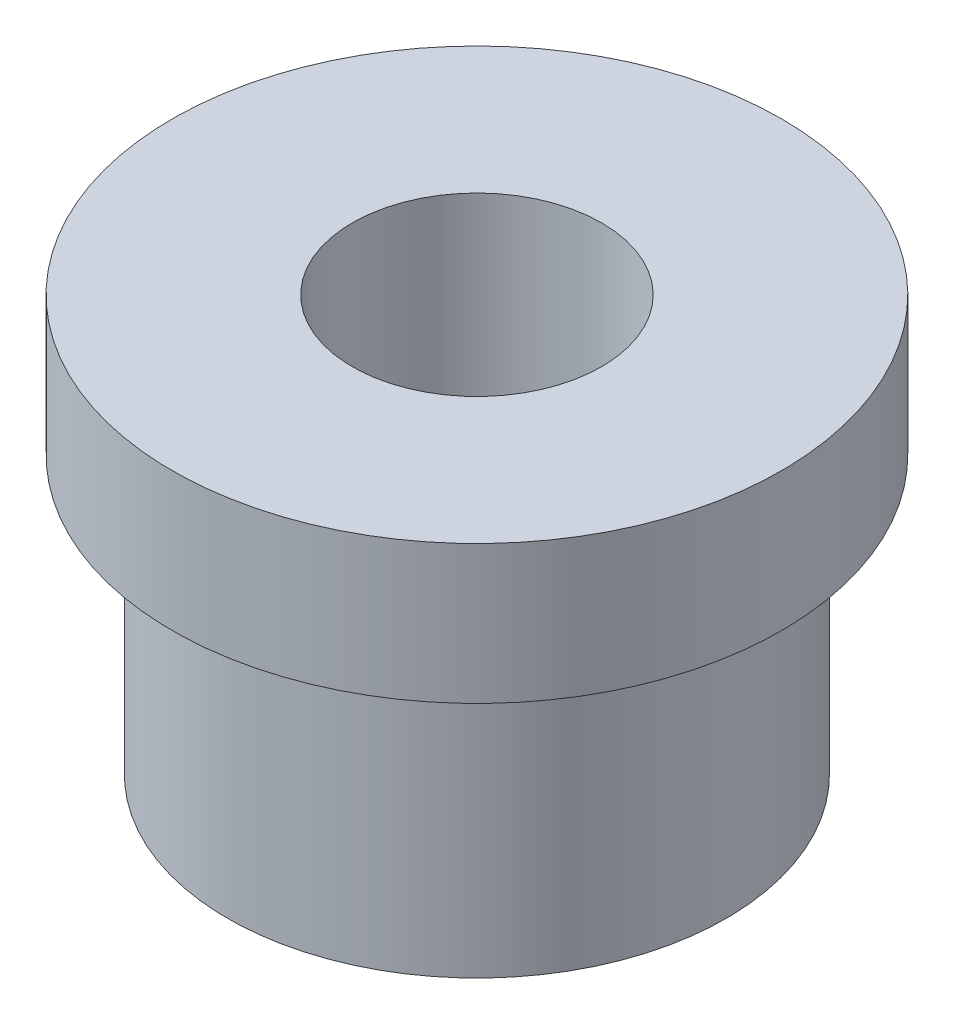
ISO-10303-21;
HEADER;
FILE_DESCRIPTION(('STEP AP214'),'2;1');
FILE_NAME('part.step','',(''),(''),'','','');
FILE_SCHEMA(('AUTOMOTIVE_DESIGN { 1 0 10303 214 1 1 1 1 }'));
ENDSEC;
DATA;
#1=APPLICATION_CONTEXT('core data for automotive mechanical design processes');
#2=APPLICATION_PROTOCOL_DEFINITION('international standard','automotive_design',2000,#1);
#3=PRODUCT_CONTEXT('',#1,'mechanical');
#4=PRODUCT('Part','Part','',(#3));
#5=PRODUCT_RELATED_PRODUCT_CATEGORY('part','',(#4));
#6=PRODUCT_DEFINITION_FORMATION('','',#4);
#7=PRODUCT_DEFINITION_CONTEXT('part definition',#1,'design');
#8=PRODUCT_DEFINITION('design','',#6,#7);
#9=PRODUCT_DEFINITION_SHAPE('','',#8);
#10=(LENGTH_UNIT() NAMED_UNIT(*) SI_UNIT(.MILLI.,.METRE.));
#11=(NAMED_UNIT(*) PLANE_ANGLE_UNIT() SI_UNIT($,.RADIAN.));
#12=(NAMED_UNIT(*) SI_UNIT($,.STERADIAN.) SOLID_ANGLE_UNIT());
#13=UNCERTAINTY_MEASURE_WITH_UNIT(LENGTH_MEASURE(1.E-05),#10,'distance_accuracy_value','');
#14=(GEOMETRIC_REPRESENTATION_CONTEXT(3) GLOBAL_UNCERTAINTY_ASSIGNED_CONTEXT((#13)) GLOBAL_UNIT_ASSIGNED_CONTEXT((#10,
#11,#12)) REPRESENTATION_CONTEXT('',''));
#15=CARTESIAN_POINT('',(0.,0.,0.));
#16=DIRECTION('',(0.,0.,1.));
#17=DIRECTION('',(1.,0.,0.));
#18=AXIS2_PLACEMENT_3D('',#15,#16,#17);
#19=CARTESIAN_POINT('',(0.,-3.,0.));
#20=DIRECTION('',(0.,-1.,0.));
#21=DIRECTION('',(0.,0.,-1.));
#22=AXIS2_PLACEMENT_3D('',#19,#20,#21);
#23=CYLINDRICAL_SURFACE('',#22,4.5);
#24=CARTESIAN_POINT('',(0.,0.,0.));
#25=DIRECTION('',(0.,-1.,0.));
#26=DIRECTION('',(0.,0.,-1.));
#27=AXIS2_PLACEMENT_3D('',#24,#25,#26);
#28=CIRCLE('',#27,4.5);
#29=CARTESIAN_POINT('',(0.,0.,-4.5));
#30=VERTEX_POINT('',#29);
#31=EDGE_CURVE('E10',#30,#30,#28,.T.);
#32=ORIENTED_EDGE('',*,*,#31,.T.);
#33=EDGE_LOOP('',(#32));
#34=FACE_BOUND('',#33,.T.);
#35=CARTESIAN_POINT('',(0.,15.,0.));
#36=DIRECTION('',(0.,-1.,0.));
#37=DIRECTION('',(0.,0.,-1.));
#38=AXIS2_PLACEMENT_3D('',#35,#36,#37);
#39=CIRCLE('',#38,4.5);
#40=CARTESIAN_POINT('',(0.,15.,-4.5));
#41=VERTEX_POINT('',#40);
#42=EDGE_CURVE('E54',#41,#41,#39,.T.);
#43=ORIENTED_EDGE('',*,*,#42,.F.);
#44=EDGE_LOOP('',(#43));
#45=FACE_BOUND('',#44,.T.);
#46=ADVANCED_FACE('F32',(#34,#45),#23,.F.);
#47=CARTESIAN_POINT('',(4.5,0.,0.));
#48=DIRECTION('',(0.,-1.,0.));
#49=DIRECTION('',(0.,0.,-1.));
#50=AXIS2_PLACEMENT_3D('',#47,#48,#49);
#51=PLANE('',#50);
#52=CARTESIAN_POINT('',(0.,0.,0.));
#53=DIRECTION('',(0.,-1.,0.));
#54=DIRECTION('',(0.,0.,-1.));
#55=AXIS2_PLACEMENT_3D('',#52,#53,#54);
#56=CIRCLE('',#55,9.);
#57=CARTESIAN_POINT('',(0.,0.,-9.));
#58=VERTEX_POINT('',#57);
#59=EDGE_CURVE('E38',#58,#58,#56,.T.);
#60=ORIENTED_EDGE('',*,*,#59,.T.);
#61=EDGE_LOOP('',(#60));
#62=FACE_BOUND('',#61,.T.);
#63=ORIENTED_EDGE('',*,*,#31,.F.);
#64=EDGE_LOOP('',(#63));
#65=FACE_BOUND('',#64,.T.);
#66=ADVANCED_FACE('F62',(#62,#65),#51,.T.);
#67=CARTESIAN_POINT('',(0.,-3.,0.));
#68=DIRECTION('',(0.,-1.,0.));
#69=DIRECTION('',(0.,0.,-1.));
#70=AXIS2_PLACEMENT_3D('',#67,#68,#69);
#71=CYLINDRICAL_SURFACE('',#70,9.);
#72=CARTESIAN_POINT('',(0.,10.,0.));
#73=DIRECTION('',(0.,-1.,0.));
#74=DIRECTION('',(0.,0.,-1.));
#75=AXIS2_PLACEMENT_3D('',#72,#73,#74);
#76=CIRCLE('',#75,9.);
#77=CARTESIAN_POINT('',(0.,10.,-9.));
#78=VERTEX_POINT('',#77);
#79=EDGE_CURVE('E42',#78,#78,#76,.T.);
#80=ORIENTED_EDGE('',*,*,#79,.T.);
#81=EDGE_LOOP('',(#80));
#82=FACE_BOUND('',#81,.T.);
#83=ORIENTED_EDGE('',*,*,#59,.F.);
#84=EDGE_LOOP('',(#83));
#85=FACE_BOUND('',#84,.T.);
#86=ADVANCED_FACE('F66',(#82,#85),#71,.T.);
#87=CARTESIAN_POINT('',(9.,10.,0.));
#88=DIRECTION('',(0.,-1.,0.));
#89=DIRECTION('',(0.,0.,-1.));
#90=AXIS2_PLACEMENT_3D('',#87,#88,#89);
#91=PLANE('',#90);
#92=CARTESIAN_POINT('',(0.,10.,0.));
#93=DIRECTION('',(0.,-1.,0.));
#94=DIRECTION('',(0.,0.,-1.));
#95=AXIS2_PLACEMENT_3D('',#92,#93,#94);
#96=CIRCLE('',#95,11.);
#97=CARTESIAN_POINT('',(0.,10.,-11.));
#98=VERTEX_POINT('',#97);
#99=EDGE_CURVE('E46',#98,#98,#96,.T.);
#100=ORIENTED_EDGE('',*,*,#99,.T.);
#101=EDGE_LOOP('',(#100));
#102=FACE_BOUND('',#101,.T.);
#103=ORIENTED_EDGE('',*,*,#79,.F.);
#104=EDGE_LOOP('',(#103));
#105=FACE_BOUND('',#104,.T.);
#106=ADVANCED_FACE('F70',(#102,#105),#91,.T.);
#107=CARTESIAN_POINT('',(0.,-3.,0.));
#108=DIRECTION('',(0.,-1.,0.));
#109=DIRECTION('',(0.,0.,-1.));
#110=AXIS2_PLACEMENT_3D('',#107,#108,#109);
#111=CYLINDRICAL_SURFACE('',#110,11.);
#112=CARTESIAN_POINT('',(0.,15.,0.));
#113=DIRECTION('',(0.,-1.,0.));
#114=DIRECTION('',(0.,0.,-1.));
#115=AXIS2_PLACEMENT_3D('',#112,#113,#114);
#116=CIRCLE('',#115,11.);
#117=CARTESIAN_POINT('',(0.,15.,-11.));
#118=VERTEX_POINT('',#117);
#119=EDGE_CURVE('E51',#118,#118,#116,.T.);
#120=ORIENTED_EDGE('',*,*,#119,.T.);
#121=EDGE_LOOP('',(#120));
#122=FACE_BOUND('',#121,.T.);
#123=ORIENTED_EDGE('',*,*,#99,.F.);
#124=EDGE_LOOP('',(#123));
#125=FACE_BOUND('',#124,.T.);
#126=ADVANCED_FACE('F77',(#122,#125),#111,.T.);
#127=CARTESIAN_POINT('',(11.,15.,0.));
#128=DIRECTION('',(0.,1.,0.));
#129=DIRECTION('',(0.,0.,1.));
#130=AXIS2_PLACEMENT_3D('',#127,#128,#129);
#131=PLANE('',#130);
#132=ORIENTED_EDGE('',*,*,#42,.T.);
#133=EDGE_LOOP('',(#132));
#134=FACE_BOUND('',#133,.T.);
#135=ORIENTED_EDGE('',*,*,#119,.F.);
#136=EDGE_LOOP('',(#135));
#137=FACE_BOUND('',#136,.T.);
#138=ADVANCED_FACE('F58',(#134,#137),#131,.T.);
#139=CLOSED_SHELL('',(#46,#66,#86,#106,#126,#138));
#140=MANIFOLD_SOLID_BREP('B2',#139);
#141=ADVANCED_BREP_SHAPE_REPRESENTATION('',(#18,#140),#14);
#142=SHAPE_DEFINITION_REPRESENTATION(#9,#141);
ENDSEC;
END-ISO-10303-21;
